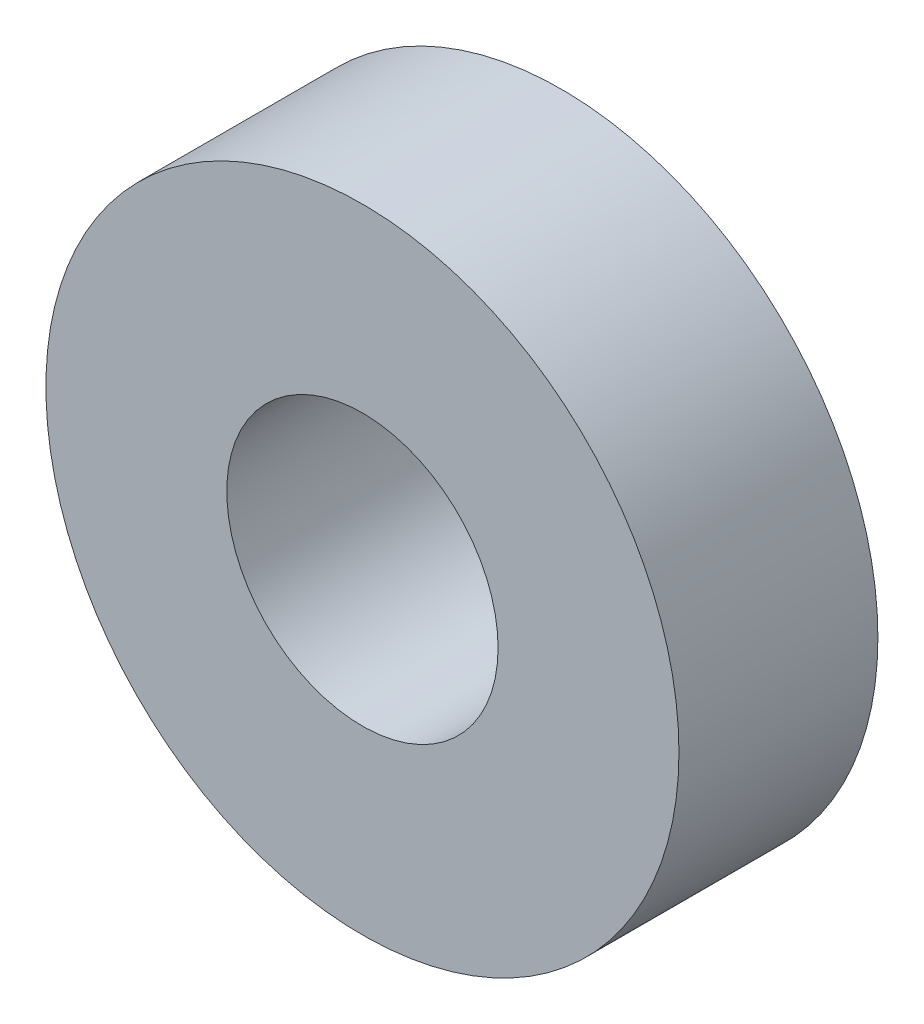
from build123d import *

# Parameters (mm, degrees)
SKETCH1_R           = 17.5
BOSS_EXTRUDE1_DEPTH = 11
SKETCH2_R           = 7.5
CUT_EXTRUDE1_DEPTH  = 28.083205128


with BuildPart() as part:
    # Sketch1 → Boss-Extrude1 (new body)
    with BuildSketch(Plane.XY):
        Circle(SKETCH1_R)
    extrude(amount=BOSS_EXTRUDE1_DEPTH)

    # Sketch2 → Cut-Extrude1 (cut, through all)
    with BuildSketch(Plane.XY.offset(11)):
        Circle(SKETCH2_R)
    extrude(amount=-CUT_EXTRUDE1_DEPTH, mode=Mode.SUBTRACT)


solid = part.part
